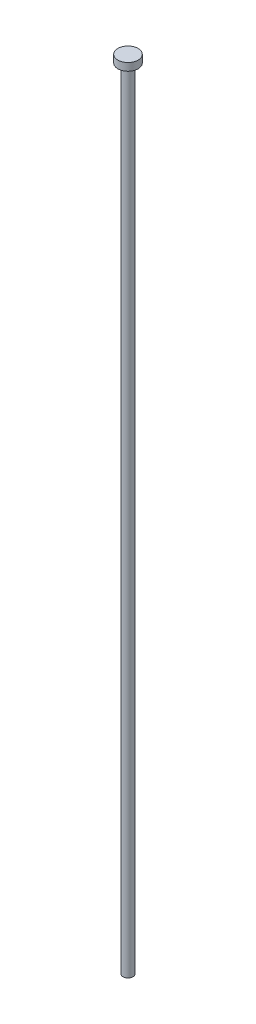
from build123d import *

# Parameters (mm, degrees)
PINDIA_R            = 2
LENGTH_DEPTH        = 315
HEADDIA_R           = 4
HEADTHICKNESS_DEPTH = 3
FILLET1_R           = 0.3


with BuildPart() as part:
    # PinDia → Length (new body)
    with BuildSketch(Plane(origin=(0, 0, 0), x_dir=(1, 0, 0), z_dir=(0, 1, 0))):
        with Locations(Location((0, 0, 0), (0, 0, 270))):
            Circle(PINDIA_R)
    extrude(amount=-LENGTH_DEPTH)

    # HeadDia → HeadThickness (add)
    with BuildSketch(Plane(origin=(0, 0, 0), x_dir=(1, 0, 0), z_dir=(0, 1, 0))):
        with Locations(Location((0, 0, 0), (0, 0, 270))):
            Circle(HEADDIA_R)
    extrude(amount=-HEADTHICKNESS_DEPTH)

    # Fillet1
    fillet1_edges = [part.edges().sort_by_distance(p)[0] for p in [
        (0, -3, -2),
    ]]
    fillet(fillet1_edges, radius=FILLET1_R)


solid = part.part
